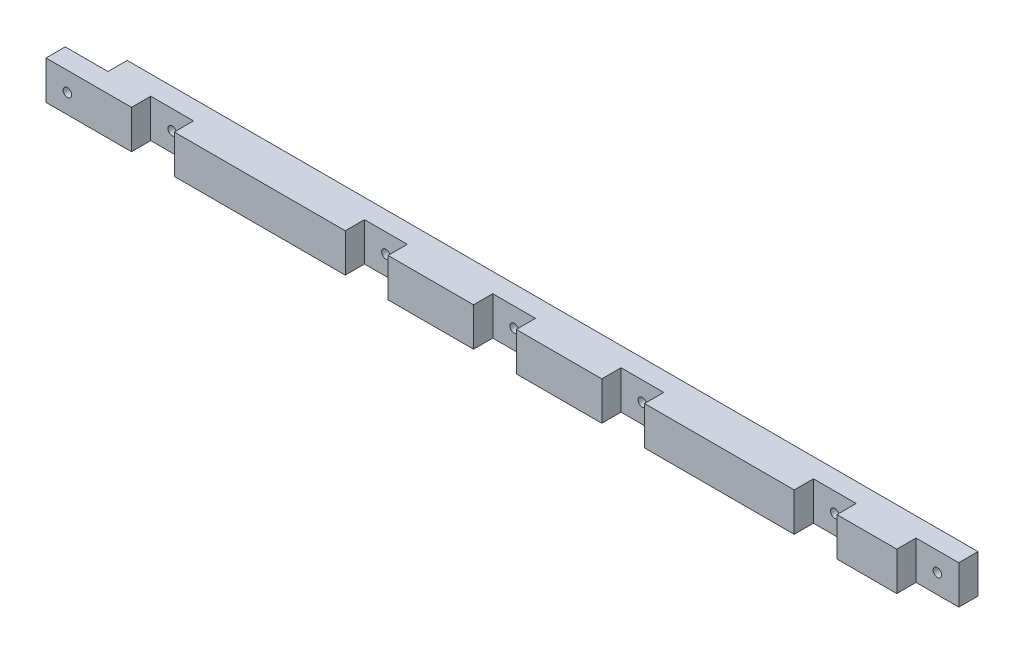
from build123d import *

# Parameters (mm, degrees)
ESQUISSE1_W              = 209
ESQUISSE1_H              = 9
EXTRUSION1_DEPTH         = 9
ESQUISSE2_W              = 10
ESQUISSE2_H              = 9
ENL_V_MAT_EXTRU_1_DEPTH  = 4.5
ESQUISSE3_R              = 1
ENL_V_MAT_EXTRU_2_DEPTH  = 4.5
ESQUISSE4_W              = 10
ESQUISSE4_H              = 9
ENL_V_MAT_EXTRU_3_DEPTH  = 4.5
ESQUISSE5_R              = 1
ENL_V_MAT_EXTRU_4_DEPTH  = 4.5
ESQUISSE6_W              = 10
ESQUISSE6_H              = 9
ENL_V_MAT_EXTRU_5_DEPTH  = 4.5
ESQUISSE7_R              = 1
ENL_V_MAT_EXTRU_6_DEPTH  = 4.5
ESQUISSE8_W              = 10
ESQUISSE8_H              = 9
ENL_V_MAT_EXTRU_7_DEPTH  = 4.5
ESQUISSE9_R              = 1
ENL_V_MAT_EXTRU_8_DEPTH  = 4.5
ESQUISSE10_W             = 10
ESQUISSE10_H             = 9
ENL_V_MAT_EXTRU_9_DEPTH  = 4.5
ESQUISSE11_R             = 1
ENL_V_MAT_EXTRU_10_DEPTH = 4.5
ESQUISSE12_W             = 10
ESQUISSE12_H             = 9
ENL_V_MAT_EXTRU_11_DEPTH = 4.5
ESQUISSE13_R             = 1
ENL_V_MAT_EXTRU_12_DEPTH = 4.5
ESQUISSE14_W             = 10
ESQUISSE14_H             = 9
ENL_V_MAT_EXTRU_13_DEPTH = 4.5
ESQUISSE15_R             = 1
ENL_V_MAT_EXTRU_14_DEPTH = 4.5


with BuildPart() as part:
    # Esquisse1 → Extrusion1 (new body)
    with BuildSketch(Plane.XY):
        with Locations((104.5, 4.5)):
            Rectangle(ESQUISSE1_W, ESQUISSE1_H)
    extrude(amount=EXTRUSION1_DEPTH)

    # Esquisse2 → Enl_v. mat.-Extru.1 (cut)
    with BuildSketch(Plane.XY.offset(9)):
        with Locations((204, 4.5)):
            Rectangle(ESQUISSE2_W, ESQUISSE2_H)
    extrude(amount=-ENL_V_MAT_EXTRU_1_DEPTH, mode=Mode.SUBTRACT)

    # Esquisse3 → Enl_v. mat.-Extru.2 (cut)
    with BuildSketch(Plane.XY.offset(4.5)):
        with Locations((204, 4.5)):
            Circle(ESQUISSE3_R)
    extrude(amount=-ENL_V_MAT_EXTRU_2_DEPTH, mode=Mode.SUBTRACT)

    # Esquisse4 → Enl_v. mat.-Extru.3 (cut)
    with BuildSketch(Plane.XY.offset(9)):
        with Locations((180, 4.5)):
            Rectangle(ESQUISSE4_W, ESQUISSE4_H)
    extrude(amount=-ENL_V_MAT_EXTRU_3_DEPTH, mode=Mode.SUBTRACT)

    # Esquisse5 → Enl_v. mat.-Extru.4 (cut)
    with BuildSketch(Plane.XY.offset(4.5)):
        with Locations((180, 4.5)):
            Circle(ESQUISSE5_R)
    extrude(amount=-ENL_V_MAT_EXTRU_4_DEPTH, mode=Mode.SUBTRACT)

    # Esquisse6 → Enl_v. mat.-Extru.5 (cut)
    with BuildSketch(Plane.XY.offset(9)):
        with Locations((135, 4.5)):
            Rectangle(ESQUISSE6_W, ESQUISSE6_H)
    extrude(amount=-ENL_V_MAT_EXTRU_5_DEPTH, mode=Mode.SUBTRACT)

    # Esquisse7 → Enl_v. mat.-Extru.6 (cut)
    with BuildSketch(Plane.XY.offset(4.5)):
        with Locations((135, 4.5)):
            Circle(ESQUISSE7_R)
    extrude(amount=-ENL_V_MAT_EXTRU_6_DEPTH, mode=Mode.SUBTRACT)

    # Esquisse8 → Enl_v. mat.-Extru.7 (cut)
    with BuildSketch(Plane.XY.offset(9)):
        with Locations((105, 4.5)):
            Rectangle(ESQUISSE8_W, ESQUISSE8_H)
    extrude(amount=-ENL_V_MAT_EXTRU_7_DEPTH, mode=Mode.SUBTRACT)

    # Esquisse9 → Enl_v. mat.-Extru.8 (cut)
    with BuildSketch(Plane.XY.offset(4.5)):
        with Locations((105, 4.5)):
            Circle(ESQUISSE9_R)
    extrude(amount=-ENL_V_MAT_EXTRU_8_DEPTH, mode=Mode.SUBTRACT)

    # Esquisse10 → Enl_v. mat.-Extru.9 (cut)
    with BuildSketch(Plane.XY.offset(9)):
        with Locations((75, 4.5)):
            Rectangle(ESQUISSE10_W, ESQUISSE10_H)
    extrude(amount=-ENL_V_MAT_EXTRU_9_DEPTH, mode=Mode.SUBTRACT)

    # Esquisse11 → Enl_v. mat.-Extru.10 (cut)
    with BuildSketch(Plane.XY.offset(4.5)):
        with Locations((75, 4.5)):
            Circle(ESQUISSE11_R)
    extrude(amount=-ENL_V_MAT_EXTRU_10_DEPTH, mode=Mode.SUBTRACT)

    # Esquisse12 → Enl_v. mat.-Extru.11 (cut)
    with BuildSketch(Plane.XY.offset(9)):
        with Locations((25, 4.5)):
            Rectangle(ESQUISSE12_W, ESQUISSE12_H)
    extrude(amount=-ENL_V_MAT_EXTRU_11_DEPTH, mode=Mode.SUBTRACT)

    # Esquisse13 → Enl_v. mat.-Extru.12 (cut)
    with BuildSketch(Plane.XY.offset(4.5)):
        with Locations((25, 4.5)):
            Circle(ESQUISSE13_R)
    extrude(amount=-ENL_V_MAT_EXTRU_12_DEPTH, mode=Mode.SUBTRACT)

    # Esquisse14 → Enl_v. mat.-Extru.13 (cut)
    with BuildSketch(Plane(origin=(0, 0, 0), x_dir=(-1, 0, 0), z_dir=(0, 0, -1))):
        with Locations((-5, 4.5)):
            Rectangle(ESQUISSE14_W, ESQUISSE14_H)
    extrude(amount=-ENL_V_MAT_EXTRU_13_DEPTH, mode=Mode.SUBTRACT)

    # Esquisse15 → Enl_v. mat.-Extru.14 (cut)
    with BuildSketch(Plane(origin=(0, 0, 4.5), x_dir=(-1, 0, 0), z_dir=(0, 0, -1))):
        with Locations((-5, 4.5)):
            Circle(ESQUISSE15_R)
    extrude(amount=-ENL_V_MAT_EXTRU_14_DEPTH, mode=Mode.SUBTRACT)


solid = part.part
